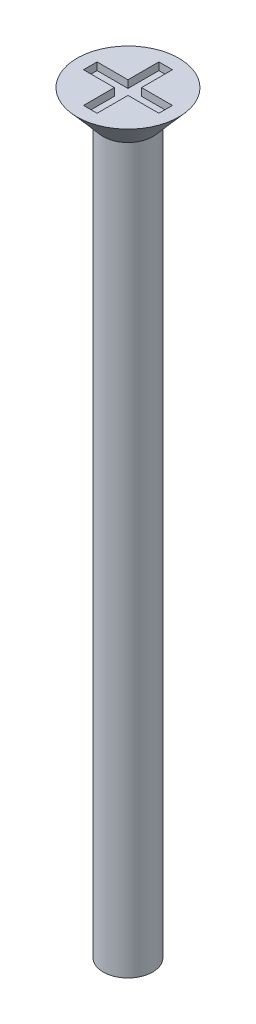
from build123d import *

# Parameters (mm, degrees)
SKETCH2_W              = 1.143
SKETCH2_H              = 3.175
PHILLIPS_DEPTH         = 0.635
PHILLIPS_PATTERN_COUNT = 4


with BuildPart() as part:
    # Sketch1 → FLATHEAD (revolve)
    with BuildSketch(Plane.XY, mode=Mode.PRIVATE) as flathead_sk:
        Polygon((0, 0), (2.0828, 0), (2.0828, 60.96), (4.290788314, 63.5), (0, 63.5), align=None)
    revolve(flathead_sk.sketch.rotate(Axis((0, 90.869303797, 0), (0, -1, 0)), 90), axis=Axis((0, 90.869303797, 0), (0, -1, 0)))

    # Sketch2 → PHILLIPS (cut)
    with BuildSketch(Plane(origin=(0, 63.5, 0), x_dir=(-1, 0, 0), z_dir=(0, 1, 0))):
        with Locations((0, 1.5875)):
            Rectangle(SKETCH2_W, SKETCH2_H)
    phillips = extrude(amount=-PHILLIPS_DEPTH, mode=Mode.SUBTRACT)

    # PHILLIPS PATTERN: PHILLIPS ×4 about axis
    phillips_pattern_axis = Axis((0, 90.869303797, 0), (0, -1, 0))
    for i in range(1, PHILLIPS_PATTERN_COUNT):
        add(phillips.rotate(phillips_pattern_axis, i * 360 / PHILLIPS_PATTERN_COUNT), mode=Mode.SUBTRACT)


solid = part.part
